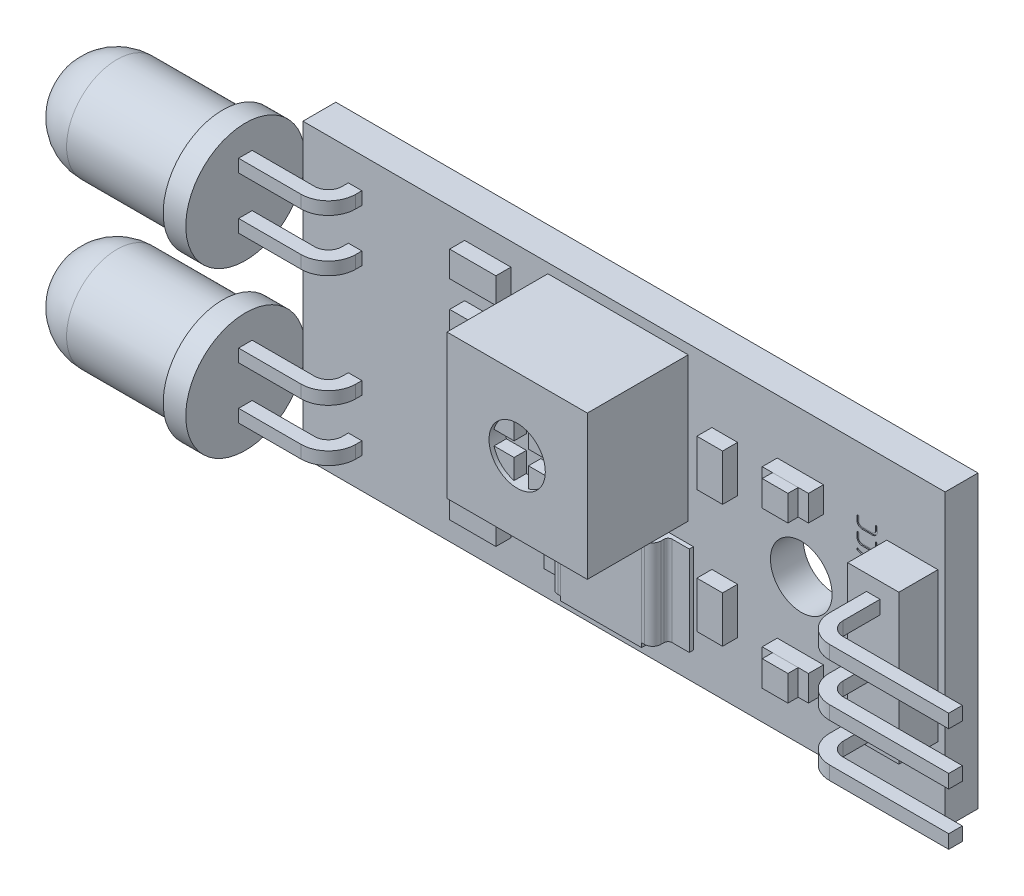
from build123d import *

# Parameters (mm, degrees)
SKETCH1_W             = 31.25
SKETCH1_H             = 14.15
SKETCH1_R             = 1.5
BOSS_EXTRUDE1_DEPTH   = 1.6
SKETCH2_W             = 6.83
SKETCH2_H             = 7.01
BOSS_EXTRUDE2_DEPTH   = 4.91
SKETCH3_R             = 1.37
CUT_EXTRUDE1_DEPTH    = 0.2
CUT_EXTRUDE2_DEPTH    = 0.6
SKETCH5_W             = 2.49
SKETCH5_H             = 7.25
BOSS_EXTRUDE3_DEPTH   = 1.9
EXTRUDE_THIN1_DEPTH   = 0.33
LPATTERN1_COUNT       = 2
LPATTERN1_PITCH       = 2.54
LPATTERN1_2_COUNT     = 2
LPATTERN1_2_PITCH     = 2.54
SKETCH7_W             = 2.25
SKETCH7_H             = 1.25
BOSS_EXTRUDE4_DEPTH   = 0.73
BOSS_EXTRUDE4_2_DEPTH = 0.73
BOSS_EXTRUDE4_3_DEPTH = 0.73
BOSS_EXTRUDE4_4_DEPTH = 0.73
BOSS_EXTRUDE4_5_DEPTH = 0.73
SKETCH7_W_2           = 1.25
SKETCH7_H_2           = 2.25
BOSS_EXTRUDE4_6_DEPTH = 0.73
BOSS_EXTRUDE4_7_DEPTH = 0.73
BOSS_EXTRUDE4_8_DEPTH = 0.73
BOSS_EXTRUDE4_9_DEPTH = 0.73
SKETCH8_W             = 1.25
SKETCH8_H             = 1.25
BOSS_EXTRUDE5_DEPTH   = 0.5
BOSS_EXTRUDE5_2_DEPTH = 0.5
SKETCH10_W            = 7.06
SKETCH10_H            = 4.36
BOSS_EXTRUDE6_DEPTH   = 0.2
SKETCH11_W            = 5
SKETCH11_H            = 4.36
BOSS_EXTRUDE7_DEPTH   = 0.75
SKETCH12_W            = 4
SKETCH12_H            = 4.8
BOSS_EXTRUDE8_DEPTH   = 0.97
BOSS_EXTRUDE8_TAPER   = 2
FILLET1_R             = 0.4
FILLET2_R             = 0.2
EXTRUDE_THIN2_DEPTH   = 0.31
LPATTERN2_COUNT       = 2
LPATTERN2_PITCH       = 2.54
LPATTERN3_COUNT       = 2
LPATTERN3_PITCH       = 8
CUT_EXTRUDE3_DEPTH    = 0.05


with BuildPart() as part:
    # Sketch1 → Boss-Extrude1 (new body)
    with BuildSketch(Plane.XY):
        with Locations((-8.625, 0)):
            Rectangle(SKETCH1_W, SKETCH1_H)
        Circle(SKETCH1_R, mode=Mode.SUBTRACT)
    extrude(amount=-BOSS_EXTRUDE1_DEPTH)

    # Sketch14 → Cut-Extrude3 (cut)
    # profile 1 of 9: a face of its own
    with BuildSketch(Plane.XY):
        with BuildLine():
            add(Edge.make_bspline(
                [(3.009027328, -3.554935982), (2.998579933, -3.555520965), (2.978074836, -3.55666911), (2.948035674, -3.561097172), (2.919420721, -3.568303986), (2.892009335, -3.577828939), (2.865997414, -3.590032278), (2.841346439, -3.604814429), (2.81815031, -3.622212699), (2.79635941, -3.641775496), (2.776440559, -3.663190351), (2.759145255, -3.686301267), (2.744161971, -3.710620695), (2.731743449, -3.736280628), (2.721883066, -3.763307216), (2.71490563, -3.791671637), (2.710019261, -3.821307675), (2.709092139, -3.84156936), (2.70862003, -3.851887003)],
                knots=[0, 0, 0, 0, 1.071120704, 2.10228816, 3.103427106, 4.088573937, 5.069289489, 6.04014042, 7.026654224, 8.033736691, 9.035236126, 10.016197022, 10.984715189, 11.955888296, 12.930301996, 13.924712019, 14.943223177, 16, 16, 16, 16], degree=3))
            add(Edge.make_bspline(
                [(2.70862003, -3.851887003), (2.709096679, -3.86220393), (2.710035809, -3.882531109), (2.714879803, -3.912242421), (2.7218881, -3.94066801), (2.731733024, -3.967702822), (2.7442239, -3.99338595), (2.759071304, -4.017858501), (2.776506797, -4.041001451), (2.796352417, -4.062600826), (2.818088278, -4.082378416), (2.841354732, -4.099759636), (2.865989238, -4.114575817), (2.892054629, -4.12669524), (2.91937203, -4.136568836), (2.948063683, -4.143594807), (2.978043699, -4.148450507), (2.998573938, -4.149380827), (3.009026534, -4.149854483)],
                knots=[0, 0, 0, 0, 1.055102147, 2.078840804, 3.071674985, 4.044544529, 5.014178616, 5.987072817, 6.966479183, 7.971488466, 8.981616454, 9.966566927, 10.935879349, 11.915040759, 12.900940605, 13.900493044, 14.931074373, 16, 16, 16, 16], degree=3))
            Line((3.009026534, -4.149854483), (3.407536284, -4.149821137))
            add(Edge.make_bspline(
                [(3.407536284, -4.149821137), (3.417875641, -4.149358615), (3.438225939, -4.148448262), (3.467962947, -4.143603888), (3.49649459, -4.13651489), (3.523682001, -4.126810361), (3.549535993, -4.114401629), (3.574229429, -4.099831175), (3.597512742, -4.082433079), (3.619060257, -4.062530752), (3.638916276, -4.041012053), (3.656322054, -4.017848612), (3.671228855, -3.993439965), (3.683442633, -3.967650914), (3.693273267, -3.940642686), (3.700595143, -3.912275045), (3.705357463, -3.882526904), (3.706308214, -3.862202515), (3.706790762, -3.851887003)],
                knots=[0, 0, 0, 0, 1.059849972, 2.086035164, 3.081242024, 4.069497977, 5.038444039, 6.016033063, 7.003337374, 8.010748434, 9.018159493, 9.999906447, 10.975125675, 11.944071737, 12.919266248, 13.916191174, 14.942376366, 16, 16, 16, 16], degree=3))
            add(Edge.make_bspline(
                [(3.706790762, -3.851887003), (3.706312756, -3.841570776), (3.705374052, -3.821311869), (3.700568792, -3.791639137), (3.693278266, -3.763332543), (3.683432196, -3.736332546), (3.671290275, -3.710566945), (3.656248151, -3.686311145), (3.638982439, -3.663179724), (3.619054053, -3.64184549), (3.597450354, -3.622157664), (3.574237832, -3.604742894), (3.54952781, -3.590206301), (3.523726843, -3.577715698), (3.496446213, -3.568354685), (3.467990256, -3.561099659), (3.438157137, -3.556620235), (3.417780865, -3.55563894), (3.407400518, -3.555139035)],
                knots=[0, 0, 0, 0, 1.059029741, 2.079712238, 3.077962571, 4.054453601, 5.024687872, 5.9952708, 6.978322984, 7.981957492, 8.986025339, 9.974642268, 10.953530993, 11.923765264, 12.911012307, 13.90754229, 14.934032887, 16, 16, 16, 16], degree=3))
            Line((3.407400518, -3.555139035), (3.009027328, -3.554935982))
        make_face()
        with BuildLine():
            add(Edge.make_bspline(
                [(3.407536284, -3.65493618), (3.414340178, -3.655400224), (3.427769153, -3.656316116), (3.447499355, -3.659012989), (3.466427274, -3.66376125), (3.484403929, -3.670301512), (3.501717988, -3.678209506), (3.517990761, -3.688073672), (3.53349917, -3.699504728), (3.548024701, -3.712398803), (3.561250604, -3.726609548), (3.572835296, -3.74189736), (3.5829054, -3.758059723), (3.591243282, -3.775140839), (3.597817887, -3.793122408), (3.602339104, -3.811969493), (3.605828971, -3.831576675), (3.606465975, -3.845028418), (3.606790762, -3.851887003)],
                knots=[0, 0, 0, 0, 1.05399557, 2.080290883, 3.073351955, 4.063759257, 5.033579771, 6.010553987, 6.99913269, 8.007915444, 9.008238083, 9.994706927, 10.968195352, 11.947019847, 12.927579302, 13.920640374, 14.939805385, 16, 16, 16, 16], degree=3))
            add(Edge.make_bspline(
                [(3.606790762, -3.851887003), (3.606465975, -3.858745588), (3.605828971, -3.872197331), (3.602339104, -3.891804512), (3.597817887, -3.910651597), (3.591243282, -3.928633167), (3.5829054, -3.945714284), (3.572835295, -3.961876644), (3.561250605, -3.977164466), (3.548024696, -3.991375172), (3.533499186, -4.004269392), (3.517990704, -4.015699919), (3.501718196, -4.025566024), (3.484403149, -4.0334668), (3.466430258, -4.040034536), (3.447478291, -4.04468078), (3.42775388, -4.04779033), (3.414254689, -4.048485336), (3.407400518, -4.048838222)],
                knots=[0, 0, 0, 0, 1.059681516, 2.078353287, 3.070933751, 4.051018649, 5.029369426, 6.002386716, 6.988378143, 7.98821666, 8.996511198, 9.984611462, 10.961112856, 11.93046401, 12.920391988, 13.912972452, 14.940318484, 16, 16, 16, 16], degree=3))
            Line((3.407400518, -4.048838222), (3.009027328, -4.048668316))
            add(Edge.make_bspline(
                [(3.009027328, -4.048668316), (3.002104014, -4.048387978), (2.98846393, -4.047835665), (2.968547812, -4.044661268), (2.94944136, -4.040081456), (2.93137189, -4.033410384), (2.913933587, -4.025628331), (2.897636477, -4.01568187), (2.882117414, -4.00434167), (2.867804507, -3.991291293), (2.854533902, -3.977242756), (2.843221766, -3.961799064), (2.833080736, -3.945770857), (2.824954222, -3.928623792), (2.818733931, -3.910577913), (2.813736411, -3.891865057), (2.810690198, -3.872169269), (2.809992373, -3.858739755), (2.80963629, -3.851887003)],
                knots=[0, 0, 0, 0, 1.068353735, 2.1048349, 3.106403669, 4.095177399, 5.07289061, 6.048253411, 7.035201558, 8.034530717, 9.033203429, 10.011754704, 10.983637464, 11.956307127, 12.931725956, 13.925736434, 14.941554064, 16, 16, 16, 16], degree=3))
            add(Edge.make_bspline(
                [(2.80963629, -3.851887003), (2.809992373, -3.845034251), (2.810690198, -3.831604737), (2.813736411, -3.811908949), (2.818733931, -3.793196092), (2.824954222, -3.775150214), (2.833080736, -3.758003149), (2.843221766, -3.74197494), (2.854533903, -3.726531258), (2.867804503, -3.712482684), (2.882117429, -3.699432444), (2.897636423, -3.68809174), (2.913933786, -3.678147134), (2.931371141, -3.670358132), (2.949444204, -3.663713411), (2.968527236, -3.659034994), (2.988490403, -3.656254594), (3.002107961, -3.655514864), (3.009026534, -3.655139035)],
                knots=[0, 0, 0, 0, 1.058512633, 2.074394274, 3.068467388, 4.043947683, 5.016678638, 5.98862264, 6.967235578, 7.965971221, 8.965363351, 9.95237369, 10.927797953, 11.905572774, 12.894408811, 13.896040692, 14.9310569, 16, 16, 16, 16], degree=3))
            Line((3.009026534, -3.655139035), (3.407536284, -3.65493618))
        make_face(mode=Mode.SUBTRACT)
    # profile 2 of 9: a face of its own
    with BuildSketch(Plane.XY):
        with BuildLine():
            add(Edge.make_bspline(
                [(2.758283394, -2.748431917), (2.754791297, -2.748731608), (2.748069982, -2.749308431), (2.738425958, -2.751896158), (2.730002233, -2.756587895), (2.722411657, -2.762446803), (2.716063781, -2.769712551), (2.711615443, -2.778239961), (2.708539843, -2.78765707), (2.708191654, -2.794340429), (2.708010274, -2.797821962)],
                knots=[0, 0, 0, 0, 1.072902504, 2.065038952, 3.030772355, 4.00649063, 4.992529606, 5.958263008, 6.936406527, 8, 8, 8, 8], degree=3))
            add(Edge.make_bspline(
                [(2.708010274, -2.797821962), (2.708206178, -2.801300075), (2.708589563, -2.808106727), (2.711571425, -2.817745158), (2.716047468, -2.826546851), (2.722476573, -2.833969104), (2.729861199, -2.84032898), (2.73847856, -2.844890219), (2.74800401, -2.84782315), (2.754736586, -2.848358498), (2.758213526, -2.84863497)],
                knots=[0, 0, 0, 0, 1.050622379, 2.056063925, 3.028133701, 4.017773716, 5.00741373, 5.961369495, 6.947179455, 8, 8, 8, 8], degree=3))
            Line((2.758213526, -2.84863497), (3.407224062, -2.848432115))
            add(Edge.make_bspline(
                [(3.407224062, -2.848432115), (3.414064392, -2.848894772), (3.427530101, -2.849805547), (3.447296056, -2.852509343), (3.466224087, -2.857257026), (3.484200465, -2.863797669), (3.501515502, -2.871704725), (3.517784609, -2.881572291), (3.533306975, -2.892990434), (3.547813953, -2.905964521), (3.561264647, -2.920030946), (3.572810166, -2.935410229), (3.582948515, -2.951500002), (3.59100796, -2.968689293), (3.597567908, -2.986643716), (3.602402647, -3.005432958), (3.605811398, -3.02507682), (3.606460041, -3.038525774), (3.606790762, -3.045382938)],
                knots=[0, 0, 0, 0, 1.058877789, 2.084481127, 3.076872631, 4.066612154, 5.03577877, 6.012094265, 7.000006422, 8.008109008, 9.01490717, 10.000710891, 10.973542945, 11.947162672, 12.927060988, 13.922042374, 14.940520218, 16, 16, 16, 16], degree=3))
            add(Edge.make_bspline(
                [(3.606790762, -3.045382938), (3.606460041, -3.052240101), (3.605811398, -3.065689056), (3.602402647, -3.085332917), (3.597567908, -3.104122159), (3.59100796, -3.122076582), (3.582948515, -3.139265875), (3.572810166, -3.155355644), (3.561264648, -3.170734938), (3.547813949, -3.184801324), (3.533306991, -3.197775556), (3.517784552, -3.209193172), (3.50151571, -3.219062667), (3.484199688, -3.226962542), (3.466227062, -3.233530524), (3.447275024, -3.2381767), (3.427550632, -3.241286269), (3.414051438, -3.241981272), (3.407197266, -3.242334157)],
                knots=[0, 0, 0, 0, 1.059337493, 2.077678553, 3.072526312, 4.052293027, 5.025781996, 5.998483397, 6.984154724, 7.990817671, 8.998784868, 9.986564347, 10.962748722, 11.931785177, 12.921391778, 13.913650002, 14.940662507, 16, 16, 16, 16], degree=3))
            Line((3.407197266, -3.242334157), (2.758283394, -3.242164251))
            add(Edge.make_bspline(
                [(2.758283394, -3.242164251), (2.754782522, -3.242424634), (2.748024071, -3.242927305), (2.738478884, -3.245877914), (2.729860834, -3.250436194), (2.722477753, -3.256797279), (2.716043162, -3.264217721), (2.711616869, -3.272967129), (2.708561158, -3.282513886), (2.708197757, -3.289260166), (2.708010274, -3.292740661)],
                knots=[0, 0, 0, 0, 1.06116171, 2.048578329, 3.004088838, 3.995341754, 4.986594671, 5.960248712, 6.947665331, 8, 8, 8, 8], degree=3))
            add(Edge.make_bspline(
                [(2.708010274, -3.292740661), (2.708206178, -3.29621878), (2.708589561, -3.303025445), (2.711571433, -3.312663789), (2.716047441, -3.3214658), (2.722476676, -3.328886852), (2.729860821, -3.335251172), (2.738479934, -3.339796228), (2.747991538, -3.342790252), (2.75473466, -3.343159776), (2.758213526, -3.343350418)],
                knots=[0, 0, 0, 0, 1.050911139, 2.056629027, 3.028965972, 4.018877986, 5.008789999, 5.963007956, 6.949088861, 8, 8, 8, 8], degree=3))
            Line((2.758213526, -3.343350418), (3.407224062, -3.343317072))
            add(Edge.make_bspline(
                [(3.407224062, -3.343317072), (3.417599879, -3.342856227), (3.437986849, -3.341950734), (3.467759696, -3.337099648), (3.49629132, -3.330010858), (3.523478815, -3.320306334), (3.549332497, -3.307897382), (3.574027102, -3.29332781), (3.597305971, -3.275926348), (3.618870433, -3.25603686), (3.638691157, -3.234440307), (3.656346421, -3.211414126), (3.671216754, -3.186926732), (3.683445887, -3.161149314), (3.693272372, -3.134137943), (3.700595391, -3.105771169), (3.705357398, -3.076022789), (3.706308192, -3.055698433), (3.706790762, -3.045382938)],
                knots=[0, 0, 0, 0, 1.063039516, 2.088718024, 3.083433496, 4.071201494, 5.039669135, 6.01677547, 7.003592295, 8.010505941, 9.017419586, 10.00286902, 10.977606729, 11.946074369, 12.920787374, 13.917220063, 14.942898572, 16, 16, 16, 16], degree=3))
            add(Edge.make_bspline(
                [(3.706790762, -3.045382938), (3.706312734, -3.035066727), (3.705373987, -3.014807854), (3.700569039, -2.985134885), (3.693277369, -2.956829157), (3.683435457, -2.929826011), (3.67127818, -2.90407204), (3.656272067, -2.879737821), (3.638757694, -2.856743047), (3.618864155, -2.835331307), (3.597243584, -2.815656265), (3.574035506, -2.798238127), (3.549324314, -2.783702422), (3.523523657, -2.771211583), (3.496242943, -2.761850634), (3.467787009, -2.75459559), (3.437953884, -2.750116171), (3.417577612, -2.749134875), (3.407197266, -2.74863497)],
                knots=[0, 0, 0, 0, 1.058752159, 2.079167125, 3.077155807, 4.053390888, 5.023370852, 5.99369938, 6.980687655, 7.984059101, 8.987863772, 9.976221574, 10.954853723, 11.924833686, 12.911821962, 13.908090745, 14.934312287, 16, 16, 16, 16], degree=3))
            Line((3.407197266, -2.74863497), (2.758283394, -2.748431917))
        make_face()
    # profile 3 of 9: a face of its own
    with BuildSketch(Plane.XY):
        with BuildLine():
            add(Edge.make_bspline(
                [(2.754895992, -2.542586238), (2.758329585, -2.542374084), (2.765026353, -2.541960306), (2.774531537, -2.53893383), (2.783283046, -2.534504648), (2.790694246, -2.528066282), (2.797129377, -2.520655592), (2.801570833, -2.511905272), (2.804565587, -2.502345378), (2.80509473, -2.495609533), (2.805367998, -2.492130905)],
                knots=[0, 0, 0, 0, 1.039221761, 2.026864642, 3.000741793, 3.99222185, 4.983701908, 5.957579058, 6.94522194, 8, 8, 8, 8], degree=3))
            Line((2.805367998, -2.492130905), (2.805472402, -2.291109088))
            Line((2.805472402, -2.291109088), (3.658246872, -2.291109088))
            add(Edge.make_bspline(
                [(3.658246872, -2.291109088), (3.661716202, -2.290922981), (3.668451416, -2.290561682), (3.677986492, -2.287507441), (3.68673842, -2.283082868), (3.694149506, -2.276643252), (3.700584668, -2.269232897), (3.705026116, -2.260482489), (3.708020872, -2.250922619), (3.708550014, -2.24418677), (3.708823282, -2.240708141)],
                knots=[0, 0, 0, 0, 1.047864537, 2.034281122, 3.006949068, 3.997198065, 4.987447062, 5.960115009, 6.946531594, 8, 8, 8, 8], degree=3))
            add(Edge.make_bspline(
                [(3.708823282, -2.240708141), (3.708541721, -2.237231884), (3.707991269, -2.230435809), (3.705071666, -2.220784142), (3.700580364, -2.2119814), (3.694150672, -2.204569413), (3.686738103, -2.198130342), (3.677986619, -2.19370523), (3.66844042, -2.190649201), (3.661694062, -2.190285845), (3.658213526, -2.190098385)],
                knots=[0, 0, 0, 0, 1.05044208, 2.053612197, 3.023485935, 4.010890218, 4.998294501, 5.968168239, 6.95175112, 8, 8, 8, 8], degree=3))
            Line((3.658213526, -2.190098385), (2.805472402, -2.189956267))
            Line((2.805472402, -2.189956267), (2.805472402, -1.989055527))
            add(Edge.make_bspline(
                [(2.805472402, -1.989055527), (2.805747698, -1.985465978), (2.806272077, -1.97862867), (2.804271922, -1.968810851), (2.800645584, -1.959908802), (2.794610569, -1.952483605), (2.78727674, -1.946351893), (2.778853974, -1.941808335), (2.769353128, -1.939071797), (2.76270376, -1.938678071), (2.759229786, -1.938472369)],
                knots=[0, 0, 0, 0, 1.099227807, 2.093789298, 3.04347335, 4.020508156, 4.994443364, 5.961479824, 6.934971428, 8, 8, 8, 8], degree=3))
            add(Edge.make_bspline(
                [(2.759229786, -1.938472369), (2.755759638, -1.938692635), (2.748987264, -1.939122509), (2.739254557, -1.941751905), (2.73064553, -1.946361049), (2.723025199, -1.952291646), (2.716672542, -1.959547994), (2.712225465, -1.968077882), (2.709149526, -1.977494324), (2.708801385, -1.984177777), (2.70862003, -1.987659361)],
                knots=[0, 0, 0, 0, 1.059749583, 2.068216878, 3.048731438, 4.020923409, 5.003398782, 5.965641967, 6.940250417, 8, 8, 8, 8], degree=3))
            Line((2.70862003, -1.987659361), (2.708653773, -2.490559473))
            add(Edge.make_bspline(
                [(2.708653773, -2.490559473), (2.708822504, -2.494090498), (2.709147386, -2.500889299), (2.712229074, -2.510481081), (2.71665139, -2.51923276), (2.72309122, -2.526645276), (2.730503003, -2.533074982), (2.739305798, -2.53756628), (2.748957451, -2.540485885), (2.755753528, -2.541036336), (2.759229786, -2.541317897)],
                knots=[0, 0, 0, 0, 1.060887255, 2.042681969, 3.010792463, 3.996401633, 4.982010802, 5.950121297, 6.951467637, 8, 8, 8, 8], degree=3))
            Line((2.759229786, -2.541317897), (2.754895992, -2.542586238))
        make_face()
    # profile 4 of 9: a face of its own
    with BuildSketch(Plane.XY):
        with BuildLine():
            add(Edge.make_bspline(
                [(3.609075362, -0.886231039), (3.608263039, -0.896447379), (3.60667633, -0.916402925), (3.59830533, -0.945047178), (3.584040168, -0.970635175), (3.565348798, -0.993238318), (3.542655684, -1.011903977), (3.516751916, -1.025873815), (3.487852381, -1.034360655), (3.467619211, -1.035867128), (3.457197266, -1.0366431)],
                knots=[0, 0, 0, 0, 1.035947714, 2.023513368, 2.993651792, 3.982645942, 4.976931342, 5.949830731, 6.943974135, 8, 8, 8, 8], degree=3))
            Line((3.457197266, -1.0366431), (2.955796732, -1.036555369))
            add(Edge.make_bspline(
                [(2.955796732, -1.036555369), (2.945435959, -1.035809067), (2.925262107, -1.034355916), (2.896470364, -1.025911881), (2.87070945, -1.011896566), (2.848244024, -0.993219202), (2.82967499, -0.970685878), (2.815987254, -0.944929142), (2.807426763, -0.916435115), (2.806064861, -0.896458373), (2.805367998, -0.886236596)],
                knots=[0, 0, 0, 0, 1.05354528, 2.051397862, 3.021863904, 4.01454802, 5.002852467, 5.970064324, 6.961314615, 8, 8, 8, 8], degree=3))
            Line((2.805367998, -0.886236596), (2.805472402, -0.584177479))
            add(Edge.make_bspline(
                [(2.805472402, -0.584177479), (2.805142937, -0.580780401), (2.80449848, -0.574135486), (2.80167547, -0.564716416), (2.797046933, -0.556249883), (2.790693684, -0.54907279), (2.783270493, -0.542820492), (2.774479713, -0.538662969), (2.764991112, -0.535554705), (2.758240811, -0.535200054), (2.754758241, -0.535017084)],
                knots=[0, 0, 0, 0, 1.043813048, 2.04176904, 2.989240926, 3.975255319, 4.963887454, 5.938477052, 6.936433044, 8, 8, 8, 8], degree=3))
            add(Edge.make_bspline(
                [(2.754758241, -0.535017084), (2.751275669, -0.535200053), (2.744525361, -0.535554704), (2.735036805, -0.538662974), (2.726245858, -0.542820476), (2.718823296, -0.549072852), (2.71246773, -0.556249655), (2.707847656, -0.564717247), (2.704989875, -0.574136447), (2.704433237, -0.580796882), (2.704148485, -0.584204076)],
                knots=[0, 0, 0, 0, 1.063384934, 2.061170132, 3.035592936, 4.024055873, 5.009901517, 5.95721125, 6.954996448, 8, 8, 8, 8], degree=3))
            Line((2.704148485, -0.584204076), (2.704319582, -0.886231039))
            add(Edge.make_bspline(
                [(2.704319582, -0.886231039), (2.704698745, -0.894921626), (2.705442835, -0.911976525), (2.709508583, -0.936912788), (2.715214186, -0.96089935), (2.723787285, -0.983626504), (2.733793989, -1.005563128), (2.746407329, -1.026136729), (2.760809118, -1.045792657), (2.777474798, -1.063929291), (2.795666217, -1.080581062), (2.815248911, -1.095209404), (2.835843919, -1.1079718), (2.85767695, -1.118334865), (2.880645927, -1.126488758), (2.904652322, -1.132598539), (2.92984362, -1.136501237), (2.947021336, -1.13740307), (2.955774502, -1.137862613)],
                knots=[0, 0, 0, 0, 1.056907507, 2.074134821, 3.067221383, 4.049829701, 5.022858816, 5.994945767, 6.978658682, 7.981741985, 8.984825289, 9.973459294, 10.949830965, 11.926376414, 12.906183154, 13.909266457, 14.934635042, 16, 16, 16, 16], degree=3))
            Line((2.955774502, -1.137862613), (3.457346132, -1.137708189))
            add(Edge.make_bspline(
                [(3.457346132, -1.137708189), (3.466050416, -1.13731179), (3.483183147, -1.136531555), (3.508318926, -1.132588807), (3.532325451, -1.126490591), (3.555296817, -1.118336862), (3.577120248, -1.107962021), (3.597705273, -1.09527516), (3.61711215, -1.080506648), (3.635314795, -1.063948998), (3.651933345, -1.04572251), (3.666595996, -1.026208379), (3.6791428, -1.005546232), (3.689262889, -0.983678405), (3.697426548, -0.960819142), (3.703561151, -0.936954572), (3.707461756, -0.911965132), (3.708363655, -0.8949221), (3.708823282, -0.886236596)],
                knots=[0, 0, 0, 0, 1.059498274, 2.085421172, 3.089046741, 4.069383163, 5.046456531, 6.023356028, 7.005942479, 8.009568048, 9.013193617, 10.002362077, 10.974974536, 11.94852967, 12.928866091, 13.924504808, 14.942282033, 16, 16, 16, 16], degree=3))
            Line((3.708823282, -0.886236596), (3.708823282, -0.584177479))
            add(Edge.make_bspline(
                [(3.708823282, -0.584177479), (3.708537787, -0.580779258), (3.707978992, -0.574127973), (3.705124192, -0.564717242), (3.700504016, -0.556249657), (3.694148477, -0.549072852), (3.686725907, -0.542820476), (3.677934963, -0.538662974), (3.668446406, -0.535554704), (3.661696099, -0.535200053), (3.658213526, -0.535017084)],
                knots=[0, 0, 0, 0, 1.042658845, 2.040780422, 2.988409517, 3.974587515, 4.963383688, 5.938134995, 6.936256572, 8, 8, 8, 8], degree=3))
            Line((3.658213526, -0.535017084), (3.156697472, -0.535005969))
            add(Edge.make_bspline(
                [(3.156697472, -0.535005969), (3.153177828, -0.535190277), (3.146390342, -0.535545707), (3.136865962, -0.538662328), (3.128075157, -0.54282065), (3.120652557, -0.549072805), (3.114297, -0.556249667), (3.109676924, -0.564717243), (3.106819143, -0.574136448), (3.106262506, -0.580796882), (3.105977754, -0.584204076)],
                knots=[0, 0, 0, 0, 1.073155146, 2.069534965, 3.042585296, 4.029655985, 5.014113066, 5.960088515, 6.956468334, 8, 8, 8, 8], degree=3))
            Line((3.105977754, -0.584204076), (3.106121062, -0.735906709))
            add(Edge.make_bspline(
                [(3.106121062, -0.735906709), (3.106323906, -0.739430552), (3.106710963, -0.746154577), (3.109782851, -0.755615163), (3.114234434, -0.764144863), (3.12058617, -0.771400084), (3.128205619, -0.777335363), (3.13676123, -0.78189575), (3.146404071, -0.784597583), (3.15311527, -0.785007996), (3.15658751, -0.785220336)],
                knots=[0, 0, 0, 0, 1.07404972, 2.049449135, 3.012473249, 3.995745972, 4.968726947, 5.950037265, 6.939390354, 8, 8, 8, 8], degree=3))
            add(Edge.make_bspline(
                [(3.15658751, -0.785220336), (3.160059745, -0.785007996), (3.166770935, -0.784597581), (3.176413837, -0.781895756), (3.184969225, -0.777335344), (3.192589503, -0.771400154), (3.198938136, -0.764144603), (3.203401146, -0.755616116), (3.206417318, -0.746186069), (3.206929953, -0.739512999), (3.207197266, -0.736033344)],
                knots=[0, 0, 0, 0, 1.062099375, 2.052842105, 3.035530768, 4.009878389, 4.994532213, 5.958908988, 6.935678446, 8, 8, 8, 8], degree=3))
            Line((3.207197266, -0.736033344), (3.213058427, -0.63377415))
            Line((3.213058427, -0.63377415), (3.606790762, -0.63377415))
            Line((3.606790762, -0.63377415), (3.609075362, -0.886231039))
        make_face()
    # profile 5 of 9: a face of its own
    with BuildSketch(Plane.XY):
        with BuildLine():
            add(Edge.make_bspline(
                [(2.758395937, 0.269454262), (2.75493266, 0.26915554), (2.748239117, 0.268578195), (2.738589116, 0.265939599), (2.730035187, 0.261362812), (2.722415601, 0.255431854), (2.716062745, 0.248175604), (2.71161572, 0.239645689), (2.708539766, 0.230229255), (2.708191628, 0.2235458), (2.708010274, 0.220064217)],
                knots=[0, 0, 0, 0, 1.062489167, 2.053493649, 3.036441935, 4.011046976, 4.995960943, 5.960592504, 6.937620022, 8, 8, 8, 8], degree=3))
            add(Edge.make_bspline(
                [(2.708010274, 0.220064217), (2.708206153, 0.216586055), (2.708589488, 0.209779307), (2.711571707, 0.200141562), (2.716046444, 0.191337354), (2.72248048, 0.1839246), (2.729892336, 0.177490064), (2.738642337, 0.173047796), (2.748137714, 0.17007602), (2.754803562, 0.16953035), (2.758213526, 0.169251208)],
                knots=[0, 0, 0, 0, 1.050917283, 2.056641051, 3.028983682, 4.018901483, 5.008819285, 5.981161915, 6.967248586, 8, 8, 8, 8], degree=3))
            Line((2.758213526, 0.169251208), (3.464663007, 0.169454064))
            Line((3.464663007, 0.169454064), (2.73462061, -0.229897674))
            add(Edge.make_bspline(
                [(2.73462061, -0.229897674), (2.730573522, -0.23254145), (2.72282417, -0.237603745), (2.714500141, -0.248530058), (2.708977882, -0.261018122), (2.708341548, -0.27011741), (2.708010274, -0.274854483)],
                knots=[0, 0, 0, 0, 1.052270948, 2.014885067, 2.966552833, 4, 4, 4, 4], degree=3))
            add(Edge.make_bspline(
                [(2.708010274, -0.274854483), (2.708206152, -0.27833265), (2.708589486, -0.285139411), (2.711571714, -0.294777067), (2.716046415, -0.303581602), (2.722480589, -0.310993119), (2.729891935, -0.317432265), (2.738643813, -0.321857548), (2.74812489, -0.324892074), (2.754801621, -0.325270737), (2.758213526, -0.325464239)],
                knots=[0, 0, 0, 0, 1.051211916, 2.057217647, 3.029832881, 4.020028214, 5.010223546, 5.982838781, 6.969201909, 8, 8, 8, 8], degree=3))
            Line((2.758213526, -0.325464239), (3.657662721, -0.325430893))
            add(Edge.make_bspline(
                [(3.657662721, -0.325430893), (3.66112197, -0.325252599), (3.667846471, -0.324906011), (3.677337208, -0.321907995), (3.685956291, -0.317365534), (3.693341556, -0.311000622), (3.699766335, -0.30357928), (3.704258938, -0.294779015), (3.707178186, -0.285126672), (3.707728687, -0.278330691), (3.708010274, -0.274854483)],
                knots=[0, 0, 0, 0, 1.045195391, 2.0317752, 2.986475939, 3.976888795, 4.967301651, 5.940130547, 6.946357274, 8, 8, 8, 8], degree=3))
            add(Edge.make_bspline(
                [(3.708010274, -0.274854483), (3.707736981, -0.271375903), (3.707207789, -0.26464015), (3.704213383, -0.2550796), (3.699770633, -0.246331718), (3.69334041, -0.238911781), (3.685956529, -0.232547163), (3.677337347, -0.228002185), (3.667825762, -0.225008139), (3.661082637, -0.224638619), (3.65760377, -0.224447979)],
                knots=[0, 0, 0, 0, 1.055410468, 2.043645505, 3.018106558, 4.010181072, 5.002255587, 5.958558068, 6.946793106, 8, 8, 8, 8], degree=3))
            Line((3.65760377, -0.224447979), (2.951395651, -0.224278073))
            Line((2.951395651, -0.224278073), (3.678640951, 0.173679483))
            add(Edge.make_bspline(
                [(3.678640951, 0.173679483), (3.682775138, 0.176120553), (3.690863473, 0.180896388), (3.700071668, 0.191798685), (3.706267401, 0.205064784), (3.707411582, 0.214911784), (3.708010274, 0.220064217)],
                knots=[0, 0, 0, 0, 0.994501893, 1.945694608, 2.925086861, 4, 4, 4, 4], degree=3))
            add(Edge.make_bspline(
                [(3.708010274, 0.220064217), (3.707742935, 0.223543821), (3.707230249, 0.230216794), (3.704214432, 0.239647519), (3.699750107, 0.248173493), (3.693406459, 0.255438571), (3.68581518, 0.261301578), (3.677390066, 0.265977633), (3.667782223, 0.268618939), (3.66107431, 0.269035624), (3.65760377, 0.269251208)],
                knots=[0, 0, 0, 0, 1.06676336, 2.045773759, 3.012363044, 3.999275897, 4.975858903, 5.942448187, 6.935463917, 8, 8, 8, 8], degree=3))
            Line((3.65760377, 0.269251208), (2.758395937, 0.269454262))
        make_face()
    # profile 6 of 9: a face of its own
    with BuildSketch(Plane.XY):
        with BuildLine():
            add(Edge.make_bspline(
                [(3.656085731, 0.481073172), (3.659527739, 0.481258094), (3.666299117, 0.481621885), (3.675900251, 0.484603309), (3.684704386, 0.489075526), (3.692118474, 0.495509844), (3.698547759, 0.502923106), (3.703039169, 0.51172551), (3.705958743, 0.52137727), (3.706509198, 0.528173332), (3.706790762, 0.531649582)],
                knots=[0, 0, 0, 0, 1.036014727, 2.038126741, 3.006977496, 3.993340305, 4.979703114, 5.948553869, 6.950665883, 8, 8, 8, 8], degree=3))
            Line((3.706790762, 0.531649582), (3.706790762, 0.828657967))
            add(Edge.make_bspline(
                [(3.706790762, 0.828657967), (3.70633299, 0.837122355), (3.705430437, 0.853810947), (3.70146862, 0.87827548), (3.69563295, 0.901786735), (3.687521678, 0.924233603), (3.676955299, 0.945504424), (3.664628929, 0.965860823), (3.650040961, 0.985118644), (3.633479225, 1.003064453), (3.615278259, 1.019420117), (3.595872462, 1.033992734), (3.575323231, 1.046411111), (3.553673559, 1.056659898), (3.53086426, 1.064535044), (3.507042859, 1.070722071), (3.481981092, 1.074628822), (3.464866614, 1.075376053), (3.456181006, 1.075755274)],
                knots=[0, 0, 0, 0, 1.042030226, 2.054491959, 3.042831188, 4.018227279, 4.983496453, 5.959639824, 6.941316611, 7.949792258, 8.958818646, 9.947157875, 10.930425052, 11.907101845, 12.887539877, 13.894085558, 14.931247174, 16, 16, 16, 16], degree=3))
            Line((3.456181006, 1.075755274), (2.958865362, 1.075958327))
            add(Edge.make_bspline(
                [(2.958865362, 1.075958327), (2.950166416, 1.075497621), (2.933110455, 1.074594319), (2.908098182, 1.070716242), (2.884288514, 1.064494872), (2.861387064, 1.056699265), (2.839714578, 1.046464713), (2.81930745, 1.033927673), (2.799923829, 1.019428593), (2.781730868, 1.003061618), (2.765161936, 0.985121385), (2.750594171, 0.965852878), (2.738210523, 0.945558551), (2.72792184, 0.924181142), (2.719821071, 0.90176139), (2.713689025, 0.878307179), (2.709739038, 0.853796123), (2.708996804, 0.837084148), (2.70862003, 0.828600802)],
                knots=[0, 0, 0, 0, 1.071361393, 2.100610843, 3.107472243, 4.096086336, 5.073069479, 6.049519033, 7.03816827, 8.047511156, 9.056303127, 10.038287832, 11.014737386, 11.976668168, 12.952370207, 13.943090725, 14.955870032, 16, 16, 16, 16], degree=3))
            Line((2.70862003, 0.828600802), (2.708653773, 0.531649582))
            add(Edge.make_bspline(
                [(2.708653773, 0.531649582), (2.708835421, 0.528171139), (2.709190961, 0.521362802), (2.712183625, 0.511727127), (2.716655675, 0.502922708), (2.723090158, 0.495509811), (2.730502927, 0.489076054), (2.739307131, 0.484601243), (2.748944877, 0.481619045), (2.755751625, 0.481235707), (2.759229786, 0.481039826)],
                knots=[0, 0, 0, 0, 1.045691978, 2.046726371, 3.014535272, 3.999837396, 4.985139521, 5.952948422, 6.953982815, 8, 8, 8, 8], degree=3))
            Line((2.759229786, 0.481039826), (3.656085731, 0.481073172))
        make_face()
        with BuildLine():
            add(Edge.make_bspline(
                [(2.809806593, 0.828657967), (2.810434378, 0.838659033), (2.811662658, 0.858226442), (2.82025591, 0.886108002), (2.834025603, 0.911213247), (2.852291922, 0.933297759), (2.874487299, 0.951737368), (2.900046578, 0.965342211), (2.928582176, 0.973682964), (2.948536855, 0.975050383), (2.958823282, 0.975755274)],
                knots=[0, 0, 0, 0, 1.031322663, 2.017816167, 2.981522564, 3.969872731, 4.958222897, 5.940395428, 6.938295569, 8, 8, 8, 8], degree=3))
            Line((2.958823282, 0.975755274), (3.456304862, 0.975958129))
            add(Edge.make_bspline(
                [(3.456304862, 0.975958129), (3.466546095, 0.975157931), (3.486509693, 0.973598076), (3.515158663, 0.965365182), (3.540945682, 0.951689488), (3.563481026, 0.933307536), (3.58223847, 0.911346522), (3.595904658, 0.886057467), (3.604797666, 0.858241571), (3.606116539, 0.838627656), (3.606790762, 0.828600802)],
                knots=[0, 0, 0, 0, 1.053772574, 2.054156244, 3.038344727, 4.033310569, 5.026423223, 5.986071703, 6.970457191, 8, 8, 8, 8], degree=3))
            Line((3.606790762, 0.828600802), (3.606790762, 0.582225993))
            Line((3.606790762, 0.582225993), (2.809806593, 0.582225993))
            Line((2.809806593, 0.582225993), (2.809806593, 0.828657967))
        make_face(mode=Mode.SUBTRACT)
    # profile 7 of 9: a face of its own
    with BuildSketch(Plane.XY):
        with BuildLine():
            Line((3.500085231, 2.23280796), (2.737224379, 1.977116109))
            add(Edge.make_bspline(
                [(2.737224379, 1.977116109), (2.734010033, 1.975819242), (2.727847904, 1.973333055), (2.719614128, 1.968001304), (2.713261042, 1.961008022), (2.708114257, 1.953185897), (2.7048231, 1.944281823), (2.703512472, 1.93489131), (2.703558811, 1.925004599), (2.705282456, 1.918550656), (2.706181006, 1.915186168)],
                knots=[0, 0, 0, 0, 1.075446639, 2.061707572, 3.014402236, 3.989148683, 4.954538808, 5.933590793, 6.922765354, 8, 8, 8, 8], degree=3))
            add(Edge.make_bspline(
                [(2.706181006, 1.915186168), (2.707491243, 1.912012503), (2.710030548, 1.905861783), (2.715651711, 1.89773119), (2.722631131, 1.891118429), (2.730866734, 1.886270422), (2.73988421, 1.882915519), (2.749487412, 1.881632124), (2.759506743, 1.88165178), (2.766027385, 1.883393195), (2.769392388, 1.884291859)],
                knots=[0, 0, 0, 0, 1.051059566, 2.037005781, 3.007493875, 3.977091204, 4.950246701, 5.937944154, 6.935868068, 8, 8, 8, 8], degree=3))
            Line((2.769392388, 1.884291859), (3.674292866, 2.185041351))
            add(Edge.make_bspline(
                [(3.674292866, 2.185041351), (3.679432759, 2.18702222), (3.689219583, 2.190793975), (3.700468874, 2.201920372), (3.707110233, 2.216375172), (3.707699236, 2.227036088), (3.708010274, 2.232665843)],
                knots=[0, 0, 0, 0, 1.040083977, 1.980414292, 2.933508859, 4, 4, 4, 4], degree=3))
            add(Edge.make_bspline(
                [(3.708010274, 2.232665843), (3.707699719, 2.238160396), (3.70711177, 2.248562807), (3.700455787, 2.262658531), (3.689080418, 2.273299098), (3.67939989, 2.277030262), (3.674270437, 2.279007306)],
                knots=[0, 0, 0, 0, 1.058680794, 2.004318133, 2.942541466, 4, 4, 4, 4], degree=3))
            Line((3.674270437, 2.279007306), (2.769537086, 2.58122323))
            add(Edge.make_bspline(
                [(2.769537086, 2.58122323), (2.766120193, 2.582043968), (2.759530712, 2.583626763), (2.749490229, 2.583713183), (2.73988347, 2.582412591), (2.73086693, 2.579062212), (2.722631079, 2.574213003), (2.715651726, 2.567600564), (2.710030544, 2.559469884), (2.707491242, 2.553319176), (2.706181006, 2.550145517)],
                knots=[0, 0, 0, 0, 1.073341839, 2.069940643, 3.056326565, 4.028189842, 4.996499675, 5.965699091, 6.950336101, 8, 8, 8, 8], degree=3))
            add(Edge.make_bspline(
                [(2.706181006, 2.550145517), (2.705284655, 2.546644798), (2.703561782, 2.539916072), (2.703491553, 2.529762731), (2.704848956, 2.520176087), (2.708118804, 2.511149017), (2.713187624, 2.503114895), (2.719682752, 2.496141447), (2.727714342, 2.490556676), (2.73389743, 2.488163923), (2.737075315, 2.486934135)],
                knots=[0, 0, 0, 0, 1.102855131, 2.119796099, 3.085264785, 4.056735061, 5.035490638, 5.974967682, 6.959206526, 8, 8, 8, 8], degree=3))
            Line((2.737075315, 2.486934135), (3.500085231, 2.23280796))
        make_face()
    # profile 8 of 9: a face of its own
    with BuildSketch(Plane.XY):
        with BuildLine():
            add(Edge.make_bspline(
                [(2.708653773, 3.034989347), (2.709011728, 3.026273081), (2.709713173, 3.009192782), (2.713694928, 2.984184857), (2.719808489, 2.960318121), (2.727981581, 2.937462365), (2.738084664, 2.915582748), (2.750669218, 2.894999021), (2.76508044, 2.87534769), (2.781737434, 2.857202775), (2.799913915, 2.840615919), (2.819312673, 2.825945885), (2.839643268, 2.813108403), (2.861486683, 2.80308265), (2.88416185, 2.794550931), (2.908146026, 2.788826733), (2.933088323, 2.784817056), (2.95013561, 2.783930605), (2.958823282, 2.783478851)],
                knots=[0, 0, 0, 0, 1.063105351, 2.083249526, 3.081203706, 4.063820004, 5.039639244, 6.014513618, 7.001047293, 8.0070069, 9.012966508, 9.997838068, 10.969977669, 11.938317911, 12.923743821, 13.919678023, 14.939822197, 16, 16, 16, 16], degree=3))
            Line((2.958823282, 2.783478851), (3.456304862, 2.783512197))
            add(Edge.make_bspline(
                [(3.456304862, 2.783512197), (3.46495085, 2.783955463), (3.482023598, 2.784830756), (3.506995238, 2.788810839), (3.530991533, 2.794513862), (3.553573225, 2.803121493), (3.575394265, 2.813161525), (3.595868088, 2.825880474), (3.61528805, 2.84062447), (3.633472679, 2.85719994), (3.650122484, 2.875350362), (3.66455383, 2.894991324), (3.677081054, 2.915635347), (3.687462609, 2.937411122), (3.695645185, 2.960293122), (3.701464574, 2.984215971), (3.705446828, 3.009168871), (3.706337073, 3.026214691), (3.706790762, 3.034901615)],
                knots=[0, 0, 0, 0, 1.05500121, 2.083251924, 3.079129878, 4.056745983, 5.025031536, 6.004147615, 6.988963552, 7.994866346, 9.000769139, 9.987247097, 10.962066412, 11.941356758, 12.923917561, 13.919795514, 14.939882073, 16, 16, 16, 16], degree=3))
            Line((3.706790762, 3.034901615), (3.706790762, 3.235890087))
            add(Edge.make_bspline(
                [(3.706790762, 3.235890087), (3.706504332, 3.239307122), (3.705939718, 3.246042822), (3.703039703, 3.255638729), (3.698547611, 3.264441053), (3.692118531, 3.271854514), (3.684704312, 3.27828812), (3.675900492, 3.282762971), (3.666262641, 3.285745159), (3.659455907, 3.286128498), (3.655977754, 3.286324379)],
                knots=[0, 0, 0, 0, 1.032641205, 2.035554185, 3.005179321, 3.992330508, 4.979481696, 5.949106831, 6.952019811, 8, 8, 8, 8], degree=3))
            add(Edge.make_bspline(
                [(3.655977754, 3.286324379), (3.65249617, 3.286143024), (3.645812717, 3.285794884), (3.636396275, 3.282718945), (3.627866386, 3.278271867), (3.620610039, 3.271919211), (3.614679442, 3.26429888), (3.610070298, 3.255689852), (3.607440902, 3.245957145), (3.607011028, 3.239184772), (3.606790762, 3.235714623)],
                knots=[0, 0, 0, 0, 1.059749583, 2.034358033, 2.996601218, 3.979076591, 4.951268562, 5.931783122, 6.940250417, 8, 8, 8, 8], degree=3))
            Line((3.606790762, 3.235714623), (3.606790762, 3.034989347))
            add(Edge.make_bspline(
                [(3.606790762, 3.034989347), (3.606119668, 3.024730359), (3.604808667, 3.004689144), (3.595900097, 2.976256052), (3.582320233, 2.950372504), (3.563485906, 2.927994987), (3.541026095, 2.909162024), (3.515168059, 2.895321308), (3.486504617, 2.886787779), (3.466469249, 2.885272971), (3.456181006, 2.884495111)],
                knots=[0, 0, 0, 0, 1.041443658, 2.034488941, 3.001517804, 3.994014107, 4.98651041, 5.96285496, 6.95391771, 8, 8, 8, 8], degree=3))
            Line((3.456181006, 2.884495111), (2.958865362, 2.884665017))
            add(Edge.make_bspline(
                [(2.958865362, 2.884665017), (2.948559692, 2.885363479), (2.92856269, 2.886718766), (2.900036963, 2.895341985), (2.874405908, 2.909115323), (2.852286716, 2.928005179), (2.833949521, 2.950505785), (2.820248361, 2.97620488), (2.811696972, 3.004704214), (2.810333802, 3.024680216), (2.80963629, 3.034901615)],
                knots=[0, 0, 0, 0, 1.05161642, 2.04054429, 3.015224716, 4.001610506, 4.989836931, 5.961249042, 6.956803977, 8, 8, 8, 8], degree=3))
            Line((2.80963629, 3.034901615), (2.809806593, 3.235890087))
            add(Edge.make_bspline(
                [(2.809806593, 3.235890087), (2.809534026, 3.239307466), (2.80899664, 3.246045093), (2.806086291, 3.255638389), (2.801597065, 3.264441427), (2.795166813, 3.271853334), (2.787754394, 3.278292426), (2.779002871, 3.282717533), (2.769456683, 3.285773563), (2.762710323, 3.286136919), (2.759229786, 3.286324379)],
                knots=[0, 0, 0, 0, 1.034835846, 2.040258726, 3.012310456, 4.001932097, 4.991553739, 5.963605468, 6.949397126, 8, 8, 8, 8], degree=3))
            add(Edge.make_bspline(
                [(2.759229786, 3.286324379), (2.755751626, 3.286128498), (2.74894488, 3.285745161), (2.739307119, 3.282762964), (2.730502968, 3.278288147), (2.72309, 3.27185441), (2.716656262, 3.264441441), (2.712181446, 3.25563729), (2.709199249, 3.24599953), (2.708815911, 3.239192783), (2.70862003, 3.235714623)],
                knots=[0, 0, 0, 0, 1.045974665, 2.046968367, 3.014737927, 4, 4.985262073, 5.953031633, 6.954025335, 8, 8, 8, 8], degree=3))
            Line((2.70862003, 3.235714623), (2.708653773, 3.034989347))
        make_face()
    # profile 9 of 9: a face of its own
    with BuildSketch(Plane.XY):
        with BuildLine():
            add(Edge.make_bspline(
                [(2.708653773, 3.737428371), (2.709011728, 3.728712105), (2.709713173, 3.711631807), (2.713694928, 3.686623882), (2.719808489, 3.662757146), (2.727981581, 3.639901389), (2.738084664, 3.618021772), (2.750669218, 3.597438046), (2.76508044, 3.577786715), (2.781737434, 3.559641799), (2.799913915, 3.543054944), (2.819312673, 3.528384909), (2.839643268, 3.515547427), (2.861486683, 3.505521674), (2.88416185, 3.496989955), (2.908146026, 3.491265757), (2.933088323, 3.48725608), (2.95013561, 3.48636963), (2.958823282, 3.485917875)],
                knots=[0, 0, 0, 0, 1.063105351, 2.083249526, 3.081203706, 4.063820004, 5.039639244, 6.014513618, 7.001047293, 8.0070069, 9.012966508, 9.997838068, 10.969977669, 11.938317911, 12.923743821, 13.919678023, 14.939822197, 16, 16, 16, 16], degree=3))
            Line((2.958823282, 3.485917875), (3.456304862, 3.485951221))
            add(Edge.make_bspline(
                [(3.456304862, 3.485951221), (3.46495085, 3.486394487), (3.482023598, 3.48726978), (3.506995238, 3.491249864), (3.530991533, 3.496952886), (3.553573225, 3.505560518), (3.575394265, 3.515600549), (3.595868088, 3.528319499), (3.61528805, 3.543063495), (3.633472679, 3.559638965), (3.650122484, 3.577789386), (3.66455383, 3.597430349), (3.677081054, 3.618074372), (3.687462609, 3.639850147), (3.695645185, 3.662732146), (3.701464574, 3.686654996), (3.705446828, 3.711607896), (3.706337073, 3.728653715), (3.706790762, 3.737340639)],
                knots=[0, 0, 0, 0, 1.05500121, 2.083251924, 3.079129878, 4.056745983, 5.025031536, 6.004147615, 6.988963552, 7.994866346, 9.000769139, 9.987247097, 10.962066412, 11.941356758, 12.923917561, 13.919795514, 14.939882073, 16, 16, 16, 16], degree=3))
            Line((3.706790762, 3.737340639), (3.706790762, 3.938329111))
            add(Edge.make_bspline(
                [(3.706790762, 3.938329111), (3.706504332, 3.941746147), (3.705939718, 3.948481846), (3.703039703, 3.958077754), (3.698547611, 3.966880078), (3.692118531, 3.974293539), (3.684704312, 3.980727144), (3.675900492, 3.985201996), (3.666262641, 3.988184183), (3.659455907, 3.988567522), (3.655977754, 3.988763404)],
                knots=[0, 0, 0, 0, 1.032641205, 2.035554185, 3.005179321, 3.992330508, 4.979481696, 5.949106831, 6.952019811, 8, 8, 8, 8], degree=3))
            add(Edge.make_bspline(
                [(3.655977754, 3.988763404), (3.65249617, 3.988582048), (3.645812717, 3.988233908), (3.636396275, 3.985157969), (3.627866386, 3.980710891), (3.620610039, 3.974358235), (3.614679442, 3.966737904), (3.610070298, 3.958128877), (3.607440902, 3.948396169), (3.607011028, 3.941623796), (3.606790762, 3.938153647)],
                knots=[0, 0, 0, 0, 1.059749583, 2.034358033, 2.996601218, 3.979076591, 4.951268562, 5.931783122, 6.940250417, 8, 8, 8, 8], degree=3))
            Line((3.606790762, 3.938153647), (3.606790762, 3.737428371))
            add(Edge.make_bspline(
                [(3.606790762, 3.737428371), (3.606119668, 3.727169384), (3.604808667, 3.707128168), (3.595900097, 3.678695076), (3.582320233, 3.652811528), (3.563485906, 3.630434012), (3.541026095, 3.611601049), (3.515168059, 3.597760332), (3.486504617, 3.589226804), (3.466469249, 3.587711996), (3.456181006, 3.586934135)],
                knots=[0, 0, 0, 0, 1.041443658, 2.034488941, 3.001517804, 3.994014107, 4.98651041, 5.96285496, 6.95391771, 8, 8, 8, 8], degree=3))
            Line((3.456181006, 3.586934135), (2.958865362, 3.587104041))
            add(Edge.make_bspline(
                [(2.958865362, 3.587104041), (2.948559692, 3.587802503), (2.92856269, 3.589157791), (2.900036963, 3.597781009), (2.874405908, 3.611554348), (2.852286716, 3.630444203), (2.833949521, 3.652944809), (2.820248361, 3.678643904), (2.811696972, 3.707143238), (2.810333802, 3.727119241), (2.80963629, 3.737340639)],
                knots=[0, 0, 0, 0, 1.05161642, 2.04054429, 3.015224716, 4.001610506, 4.989836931, 5.961249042, 6.956803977, 8, 8, 8, 8], degree=3))
            Line((2.80963629, 3.737340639), (2.809806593, 3.938329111))
            add(Edge.make_bspline(
                [(2.809806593, 3.938329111), (2.809534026, 3.94174649), (2.80899664, 3.948484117), (2.806086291, 3.958077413), (2.801597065, 3.966880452), (2.795166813, 3.974292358), (2.787754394, 3.980731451), (2.779002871, 3.985156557), (2.769456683, 3.988212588), (2.762710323, 3.988575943), (2.759229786, 3.988763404)],
                knots=[0, 0, 0, 0, 1.034835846, 2.040258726, 3.012310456, 4.001932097, 4.991553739, 5.963605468, 6.949397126, 8, 8, 8, 8], degree=3))
            add(Edge.make_bspline(
                [(2.759229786, 3.988763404), (2.755751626, 3.988567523), (2.74894488, 3.988184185), (2.739307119, 3.985201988), (2.730502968, 3.980727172), (2.72309, 3.974293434), (2.716656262, 3.966880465), (2.712181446, 3.958076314), (2.709199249, 3.948438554), (2.708815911, 3.941631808), (2.70862003, 3.938153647)],
                knots=[0, 0, 0, 0, 1.045974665, 2.046968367, 3.014737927, 4, 4.985262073, 5.953031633, 6.954025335, 8, 8, 8, 8], degree=3))
            Line((2.70862003, 3.938153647), (2.708653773, 3.737428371))
        make_face()
    extrude(amount=-CUT_EXTRUDE3_DEPTH, mode=Mode.SUBTRACT)


with BuildPart() as body_2:
    # Sketch2 → Boss-Extrude2 (new body)
    with BuildSketch(Plane.XY):
        with Locations((-8.915, 3.1)):
            Rectangle(SKETCH2_W, SKETCH2_H)
    extrude(amount=BOSS_EXTRUDE2_DEPTH)

    # Sketch3 → Cut-Extrude1 (cut)
    with BuildSketch(Plane.XY.offset(4.91)):
        with Locations((-8.915, 3.1)):
            Circle(SKETCH3_R)
    extrude(amount=-CUT_EXTRUDE1_DEPTH, mode=Mode.SUBTRACT)

    # Sketch4 → Cut-Extrude2 (cut)
    with BuildSketch(Plane.XY.offset(4.71)):
        with BuildLine():
            Line((-9.265, 4.424537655), (-9.265, 3.45))
            Line((-9.265, 3.45), (-10.239537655, 3.45))
            ThreePointArc((-10.239537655, 3.45), (-10.285, 3.1), (-10.239537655, 2.75))
            Line((-10.239537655, 2.75), (-9.265, 2.75))
            Line((-9.265, 2.75), (-9.265, 1.775462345))
            ThreePointArc((-9.265, 1.775462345), (-8.915, 1.73), (-8.565, 1.775462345))
            Line((-8.565, 1.775462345), (-8.565, 2.75))
            Line((-8.565, 2.75), (-7.590462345, 2.75))
            ThreePointArc((-7.590462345, 2.75), (-7.545, 3.1), (-7.590462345, 3.45))
            Line((-7.590462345, 3.45), (-8.565, 3.45))
            Line((-8.565, 3.45), (-8.565, 4.424537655))
            ThreePointArc((-8.565, 4.424537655), (-8.915, 4.47), (-9.265, 4.424537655))
        make_face()
    extrude(amount=-CUT_EXTRUDE2_DEPTH, mode=Mode.SUBTRACT)


with BuildPart() as body_3:
    # Sketch5 → Boss-Extrude3 (new body)
    with BuildSketch(Plane.XY):
        with Locations((5.405, 0)):
            Rectangle(SKETCH5_W, SKETCH5_H)
    extrude(amount=BOSS_EXTRUDE3_DEPTH)


with BuildPart() as body_4:
    # Sketch6 → Extrude-Thin1 (new, symmetric)
    with BuildSketch(Plane(origin=(0, 0, 0), x_dir=(1, 0, 0), z_dir=(0, 1, 0))):
        with BuildLine():
            Line((12.205, -4.37), (6.405, -4.37))
            ThreePointArc((6.405, -4.37), (5.931238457, -4.173761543), (5.735, -3.7))
            Line((5.735, -3.7), (5.735, 2.6))
            Line((5.735, 2.6), (5.075, 2.6))
            Line((5.075, 2.6), (5.075, -3.7))
            ThreePointArc((5.075, -3.7), (5.464547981, -4.640452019), (6.405, -5.03))
            Line((6.405, -5.03), (12.205, -5.03))
            Line((12.205, -5.03), (12.205, -4.37))
        make_face()
    extrude(amount=EXTRUDE_THIN1_DEPTH, both=True)


with BuildPart() as lpattern1_1:
    # LPattern1: pattern copy
    add(body_4.part.moved(Location(Vector(0, 1, 0) * (1 * LPATTERN1_PITCH))))


with BuildPart() as lpattern1_2_1:
    # LPattern1 2: pattern copy
    add(body_4.part.moved(Location(Vector(0, -1, 0) * (1 * LPATTERN1_2_PITCH))))


with BuildPart() as body_7:
    # Sketch7 → Boss-Extrude4 (new body)
    with BuildSketch(Plane.XY):
        with Locations((-15.255, 5.36)):
            Rectangle(SKETCH7_W, SKETCH7_H)
    extrude(amount=BOSS_EXTRUDE4_DEPTH)


with BuildPart() as body_8:
    # Sketch7 → Boss-Extrude4 2 (new body)
    with BuildSketch(Plane.XY):
        with Locations((-15.255, 2.82)):
            Rectangle(SKETCH7_W, SKETCH7_H)
    extrude(amount=BOSS_EXTRUDE4_2_DEPTH)


with BuildPart() as body_9:
    # Sketch7 → Boss-Extrude4 3 (new body)
    with BuildSketch(Plane.XY):
        with Locations((-15.255, 0.28)):
            Rectangle(SKETCH7_W, SKETCH7_H)
    extrude(amount=BOSS_EXTRUDE4_3_DEPTH)


with BuildPart() as body_10:
    # Sketch7 → Boss-Extrude4 4 (new body)
    with BuildSketch(Plane.XY):
        with Locations((-15.255, -2.26)):
            Rectangle(SKETCH7_W, SKETCH7_H)
    extrude(amount=BOSS_EXTRUDE4_4_DEPTH)


with BuildPart() as body_11:
    # Sketch7 → Boss-Extrude4 5 (new body)
    with BuildSketch(Plane.XY):
        with Locations((-15.255, -4.8)):
            Rectangle(SKETCH7_W, SKETCH7_H)
    extrude(amount=BOSS_EXTRUDE4_5_DEPTH)


with BuildPart() as body_12:
    # Sketch7 → Boss-Extrude4 6 (new body)
    with BuildSketch(Plane.XY):
        with Locations((-3.725, 2.99)):
            Rectangle(SKETCH7_W_2, SKETCH7_H_2)
    extrude(amount=BOSS_EXTRUDE4_6_DEPTH)


with BuildPart() as body_13:
    # Sketch7 → Boss-Extrude4 7 (new body)
    with BuildSketch(Plane.XY):
        with Locations((-0.045, 3.795)):
            Rectangle(SKETCH7_W, SKETCH7_H)
    extrude(amount=BOSS_EXTRUDE4_7_DEPTH)


with BuildPart() as body_14:
    # Sketch7 → Boss-Extrude4 8 (new body)
    with BuildSketch(Plane.XY):
        with Locations((-0.045, -3.795)):
            Rectangle(SKETCH7_W, SKETCH7_H)
    extrude(amount=BOSS_EXTRUDE4_8_DEPTH)


with BuildPart() as body_15:
    # Sketch7 → Boss-Extrude4 9 (new body)
    with BuildSketch(Plane.XY):
        with Locations((-3.725, -2.99)):
            Rectangle(SKETCH7_W_2, SKETCH7_H_2)
    extrude(amount=BOSS_EXTRUDE4_9_DEPTH)


with BuildPart() as body_16:
    # Sketch8 → Boss-Extrude5 (new body)
    with BuildSketch(Plane.XY.offset(0.73)):
        with Locations((-0.045, 3.795)):
            Rectangle(SKETCH8_W, SKETCH8_H)
    extrude(amount=BOSS_EXTRUDE5_DEPTH)


with BuildPart() as body_17:
    # Sketch8 → Boss-Extrude5 2 (new body)
    with BuildSketch(Plane.XY.offset(0.73)):
        with Locations((-0.045, -3.795)):
            Rectangle(SKETCH8_W, SKETCH8_H)
    extrude(amount=BOSS_EXTRUDE5_2_DEPTH)


with BuildPart() as body_18:
    # Sketch9 → Revolve1 (revolve)
    with BuildSketch(Plane(origin=(0, 4, 0), x_dir=(1, 0, 0), z_dir=(0, 1, 0)), mode=Mode.PRIVATE) as revolve1_sk:
        with BuildLine():
            Line((-25.75, -1.3), (-25.75, -4.2))
            Line((-25.75, -4.2), (-26.85, -4.2))
            Line((-26.85, -4.2), (-26.85, -3.75))
            Line((-26.85, -3.75), (-32, -3.75))
            ThreePointArc((-32, -3.75), (-33.732411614, -3.032411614), (-34.45, -1.3))
            Line((-34.45, -1.3), (-25.75, -1.3))
        make_face()
    revolve(revolve1_sk.sketch.rotate(Axis((-25.75, 4, 1.3), (-1, 0, 0)), 180), axis=Axis((-25.75, 4, 1.3), (-1, 0, 0)))


with BuildPart() as body_19:
    # Sketch10 → Boss-Extrude6 (new body)
    with BuildSketch(Plane.XY):
        with Locations((-8.78, -3.535)):
            Rectangle(SKETCH10_W, SKETCH10_H)
    extrude(amount=BOSS_EXTRUDE6_DEPTH)

    # Sketch11 → Boss-Extrude7 (add)
    with BuildSketch(Plane.XY.offset(0.2)):
        with Locations((-8.78, -3.535)):
            Rectangle(SKETCH11_W, SKETCH11_H)
    extrude(amount=BOSS_EXTRUDE7_DEPTH)

    # Fillet1
    fillet1_edges = [body_19.edges().sort_by_distance(p)[0] for p in [
        (-6.28, -3.535, 0.95),
        (-11.28, -3.535, 0.95),
    ]]
    fillet(fillet1_edges, radius=FILLET1_R)

    # Fillet2
    fillet2_edges = [body_19.edges().sort_by_distance(p)[0] for p in [
        (-6.28, -3.535, 0.2),
        (-11.28, -3.535, 0.2),
    ]]
    fillet(fillet2_edges, radius=FILLET2_R)


with BuildPart() as body_20:
    # Sketch12 → Boss-Extrude8 (new body)
    with BuildSketch(Plane.XY):
        with Locations((-8.78, -3.535)):
            Rectangle(SKETCH12_W, SKETCH12_H)
    extrude(amount=BOSS_EXTRUDE8_DEPTH, taper=BOSS_EXTRUDE8_TAPER)


with BuildPart() as body_21:
    # Sketch13 → Extrude-Thin2 (new, symmetric)
    with BuildSketch(Plane(origin=(0, 5.27, 0), x_dir=(1, 0, 0), z_dir=(0, 1, 0))):
        with BuildLine():
            Line((-25.75, -1.63), (-22.71, -1.63))
            ThreePointArc((-22.71, -1.63), (-21.769547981, -1.240452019), (-21.38, -0.3))
            Line((-21.38, -0.3), (-21.38, 2.6))
            Line((-21.38, 2.6), (-22.04, 2.6))
            Line((-22.04, 2.6), (-22.04, -0.3))
            ThreePointArc((-22.04, -0.3), (-22.236238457, -0.773761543), (-22.71, -0.97))
            Line((-22.71, -0.97), (-25.75, -0.97))
            Line((-25.75, -0.97), (-25.75, -1.63))
        make_face()
    extrude(amount=EXTRUDE_THIN2_DEPTH, both=True)


with BuildPart() as lpattern2_1:
    # LPattern2: pattern copy
    add(body_21.part.moved(Location(Vector(0, -1, 0) * (1 * LPATTERN2_PITCH))))


with BuildPart() as lpattern3_1:
    # LPattern3: pattern copy
    add(lpattern2_1.part.moved(Location(Vector(0, -1, 0) * (1 * LPATTERN3_PITCH))))


with BuildPart() as lpattern3_2:
    # LPattern3: pattern copy
    add(body_21.part.moved(Location(Vector(0, -1, 0) * (1 * LPATTERN3_PITCH))))


with BuildPart() as lpattern3_3:
    # LPattern3: pattern copy
    add(body_18.part.moved(Location(Vector(0, -1, 0) * (1 * LPATTERN3_PITCH))))


solid = Compound([part.part, body_2.part, body_3.part, body_4.part, lpattern1_1.part, lpattern1_2_1.part, body_7.part, body_8.part, body_9.part, body_10.part, body_11.part, body_12.part, body_13.part, body_14.part, body_15.part, body_16.part, body_17.part, body_18.part, body_19.part, body_20.part, body_21.part, lpattern2_1.part, lpattern3_1.part, lpattern3_2.part, lpattern3_3.part])
